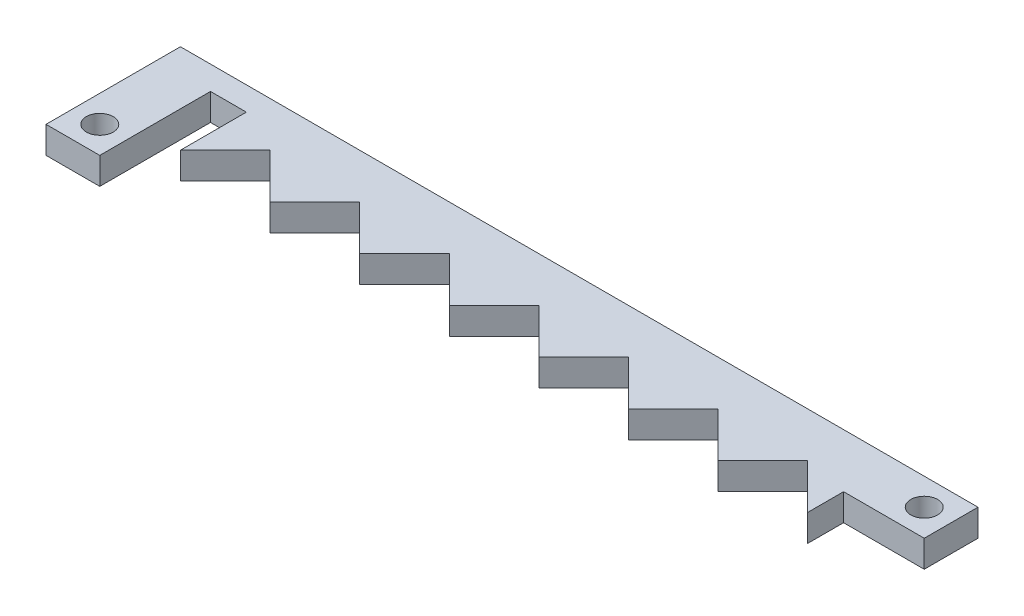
from build123d import *

# Parameters (mm, degrees)
SKETCH1_R           = 1.5
BOSS_EXTRUDE1_DEPTH = 3


with BuildPart() as part:
    # Sketch1 → Boss-Extrude1 (new body)
    with BuildSketch(Plane(origin=(0, 0, 0), x_dir=(1, 0, 0), z_dir=(0, 1, 0))):
        Polygon((0, 42.341154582), (0, 38.341154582), (5, 43.341154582), (10, 38.341154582), (15, 43.341154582), (20, 38.341154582), (25, 43.341154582), (30, 38.341154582), (35, 43.341154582), (40, 38.341154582), (45, 43.341154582), (50, 38.341154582), (55, 43.341154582), (60, 38.341154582), (65, 43.341154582), (70, 38.341154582), (70, 42.341154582), (79, 42.341154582), (79, 48.341154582), (70, 48.341154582), (5, 48.341154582), (0, 48.341154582), (-10, 48.341154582), (-10, 33.341154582), (-4, 33.341154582), (-4, 45.696811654), (0, 45.696811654), align=None)
        with Locations(Location((-7, 36.341154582, 0), (0, 0, 270))):
            Circle(SKETCH1_R, mode=Mode.SUBTRACT)
        with Locations(Location((76, 45.341154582, 0), (0, 0, 270))):
            Circle(SKETCH1_R, mode=Mode.SUBTRACT)
    extrude(amount=BOSS_EXTRUDE1_DEPTH)


solid = part.part
